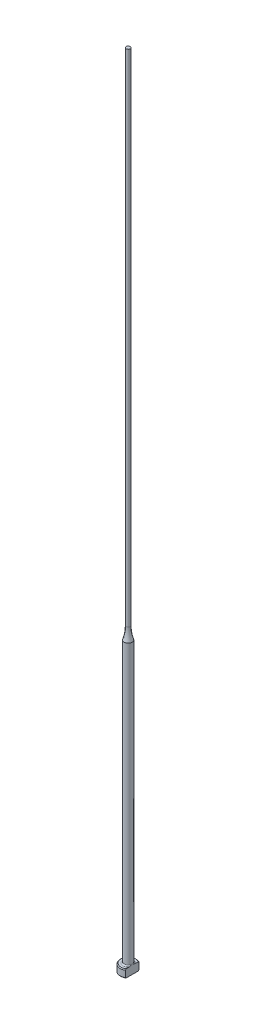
ISO-10303-21;
HEADER;
FILE_DESCRIPTION(('STEP AP214'),'2;1');
FILE_NAME('part.step','',(''),(''),'','','');
FILE_SCHEMA(('AUTOMOTIVE_DESIGN { 1 0 10303 214 1 1 1 1 }'));
ENDSEC;
DATA;
#1=APPLICATION_CONTEXT('core data for automotive mechanical design processes');
#2=APPLICATION_PROTOCOL_DEFINITION('international standard','automotive_design',2000,#1);
#3=PRODUCT_CONTEXT('',#1,'mechanical');
#4=PRODUCT('Part','Part','',(#3));
#5=PRODUCT_RELATED_PRODUCT_CATEGORY('part','',(#4));
#6=PRODUCT_DEFINITION_FORMATION('','',#4);
#7=PRODUCT_DEFINITION_CONTEXT('part definition',#1,'design');
#8=PRODUCT_DEFINITION('design','',#6,#7);
#9=PRODUCT_DEFINITION_SHAPE('','',#8);
#10=(LENGTH_UNIT() NAMED_UNIT(*) SI_UNIT(.MILLI.,.METRE.));
#11=(NAMED_UNIT(*) PLANE_ANGLE_UNIT() SI_UNIT($,.RADIAN.));
#12=(NAMED_UNIT(*) SI_UNIT($,.STERADIAN.) SOLID_ANGLE_UNIT());
#13=UNCERTAINTY_MEASURE_WITH_UNIT(LENGTH_MEASURE(1.E-05),#10,'distance_accuracy_value','');
#14=(GEOMETRIC_REPRESENTATION_CONTEXT(3) GLOBAL_UNCERTAINTY_ASSIGNED_CONTEXT((#13)) GLOBAL_UNIT_ASSIGNED_CONTEXT((#10,
#11,#12)) REPRESENTATION_CONTEXT('',''));
#15=CARTESIAN_POINT('',(0.,0.,0.));
#16=DIRECTION('',(0.,0.,1.));
#17=DIRECTION('',(1.,0.,0.));
#18=AXIS2_PLACEMENT_3D('',#15,#16,#17);
#19=CARTESIAN_POINT('',(-1.99999999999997,2.,0.));
#20=DIRECTION('',(0.,1.,0.));
#21=DIRECTION('',(0.,0.,1.));
#22=AXIS2_PLACEMENT_3D('',#19,#20,#21);
#23=PLANE('',#22);
#24=CARTESIAN_POINT('',(0.,2.,0.));
#25=DIRECTION('',(0.,1.,0.));
#26=DIRECTION('',(0.,0.,1.));
#27=AXIS2_PLACEMENT_3D('',#24,#25,#26);
#28=CIRCLE('',#27,1.8);
#29=CARTESIAN_POINT('',(0.999999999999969,2.,-1.4966629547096));
#30=VERTEX_POINT('',#29);
#31=CARTESIAN_POINT('',(0.999999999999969,2.,1.4966629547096));
#32=VERTEX_POINT('',#31);
#33=EDGE_CURVE('E187',#30,#32,#28,.T.);
#34=ORIENTED_EDGE('',*,*,#33,.T.);
#35=DIRECTION('',(0.,0.,-1.));
#36=VECTOR('',#35,1.);
#37=CARTESIAN_POINT('',(0.999999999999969,2.,0.));
#38=LINE('',#37,#36);
#39=CARTESIAN_POINT('',(0.999999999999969,2.00000000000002,0.830662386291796));
#40=VERTEX_POINT('',#39);
#41=EDGE_CURVE('E57',#32,#40,#38,.T.);
#42=ORIENTED_EDGE('',*,*,#41,.T.);
#43=CARTESIAN_POINT('',(0.,2.,0.));
#44=DIRECTION('',(0.,1.,0.));
#45=DIRECTION('',(0.,0.,1.));
#46=AXIS2_PLACEMENT_3D('',#43,#44,#45);
#47=CIRCLE('',#46,1.29999999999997);
#48=CARTESIAN_POINT('',(0.999999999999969,2.00000000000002,-0.830662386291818));
#49=VERTEX_POINT('',#48);
#50=EDGE_CURVE('E108',#40,#49,#47,.F.);
#51=ORIENTED_EDGE('',*,*,#50,.T.);
#52=EDGE_CURVE('E137',#49,#30,#38,.T.);
#53=ORIENTED_EDGE('',*,*,#52,.T.);
#54=EDGE_LOOP('',(#34,#42,#51,#53));
#55=FACE_BOUND('',#54,.T.);
#56=ADVANCED_FACE('F32',(#55),#23,.T.);
#57=CARTESIAN_POINT('',(0.,259.958771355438,0.));
#58=DIRECTION('',(0.,1.,0.));
#59=DIRECTION('',(0.,0.,1.));
#60=AXIS2_PLACEMENT_3D('',#57,#58,#59);
#61=CYLINDRICAL_SURFACE('',#60,1.99999999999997);
#62=CARTESIAN_POINT('',(0.,1.80000000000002,0.));
#63=DIRECTION('',(0.,1.,0.));
#64=DIRECTION('',(0.,0.,1.));
#65=AXIS2_PLACEMENT_3D('',#62,#63,#64);
#66=CIRCLE('',#65,1.99999999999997);
#67=CARTESIAN_POINT('',(0.999999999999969,1.80000000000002,1.73205080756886));
#68=VERTEX_POINT('',#67);
#69=CARTESIAN_POINT('',(0.999999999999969,1.80000000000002,-1.73205080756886));
#70=VERTEX_POINT('',#69);
#71=EDGE_CURVE('E105',#68,#70,#66,.F.);
#72=ORIENTED_EDGE('',*,*,#71,.T.);
#73=DIRECTION('',(0.,-1.,0.));
#74=VECTOR('',#73,1.);
#75=CARTESIAN_POINT('',(0.999999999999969,200.,-1.73205080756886));
#76=LINE('',#75,#74);
#77=CARTESIAN_POINT('',(0.999999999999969,0.199999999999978,-1.73205080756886));
#78=VERTEX_POINT('',#77);
#79=EDGE_CURVE('E193',#70,#78,#76,.T.);
#80=ORIENTED_EDGE('',*,*,#79,.T.);
#81=CARTESIAN_POINT('',(0.,0.199999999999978,0.));
#82=DIRECTION('',(0.,-1.,0.));
#83=DIRECTION('',(0.,0.,-1.));
#84=AXIS2_PLACEMENT_3D('',#81,#82,#83);
#85=CIRCLE('',#84,1.99999999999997);
#86=CARTESIAN_POINT('',(0.999999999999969,0.199999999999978,1.73205080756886));
#87=VERTEX_POINT('',#86);
#88=EDGE_CURVE('E100',#78,#87,#85,.F.);
#89=ORIENTED_EDGE('',*,*,#88,.T.);
#90=DIRECTION('',(0.,-1.,0.));
#91=VECTOR('',#90,1.);
#92=CARTESIAN_POINT('',(0.999999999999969,200.,1.73205080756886));
#93=LINE('',#92,#91);
#94=EDGE_CURVE('E93',#68,#87,#93,.T.);
#95=ORIENTED_EDGE('',*,*,#94,.F.);
#96=EDGE_LOOP('',(#72,#80,#89,#95));
#97=FACE_BOUND('',#96,.T.);
#98=ADVANCED_FACE('F158',(#97),#61,.T.);
#99=CARTESIAN_POINT('',(0.,0.,0.));
#100=DIRECTION('',(0.,-1.,0.));
#101=DIRECTION('',(0.,0.,-1.));
#102=AXIS2_PLACEMENT_3D('',#99,#100,#101);
#103=PLANE('',#102);
#104=CARTESIAN_POINT('',(0.,0.,0.));
#105=DIRECTION('',(0.,-1.,0.));
#106=DIRECTION('',(0.,0.,-1.));
#107=AXIS2_PLACEMENT_3D('',#104,#105,#106);
#108=CIRCLE('',#107,1.8);
#109=CARTESIAN_POINT('',(0.999999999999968,0.,1.49666295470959));
#110=VERTEX_POINT('',#109);
#111=CARTESIAN_POINT('',(0.999999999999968,0.,-1.49666295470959));
#112=VERTEX_POINT('',#111);
#113=EDGE_CURVE('E98',#110,#112,#108,.T.);
#114=ORIENTED_EDGE('',*,*,#113,.T.);
#115=DIRECTION('',(0.,0.,1.));
#116=VECTOR('',#115,1.);
#117=CARTESIAN_POINT('',(0.999999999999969,0.,-1.73205080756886));
#118=LINE('',#117,#116);
#119=EDGE_CURVE('E83',#112,#110,#118,.T.);
#120=ORIENTED_EDGE('',*,*,#119,.T.);
#121=EDGE_LOOP('',(#114,#120));
#122=FACE_BOUND('',#121,.T.);
#123=ADVANCED_FACE('F103',(#122),#103,.T.);
#124=CARTESIAN_POINT('',(0.,2.,0.));
#125=DIRECTION('',(0.,-1.,0.));
#126=DIRECTION('',(0.,0.,-1.));
#127=AXIS2_PLACEMENT_3D('',#124,#125,#126);
#128=CONICAL_SURFACE('',#127,1.8,0.785398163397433);
#129=ORIENTED_EDGE('',*,*,#71,.F.);
#130=CARTESIAN_POINT('',(0.999999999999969,-0.143084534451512,3.81417299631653));
#131=CARTESIAN_POINT('',(0.999999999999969,-0.0593997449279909,3.72765647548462));
#132=CARTESIAN_POINT('',(0.999999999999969,0.0241940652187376,3.64105173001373));
#133=CARTESIAN_POINT('',(0.999999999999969,0.191148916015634,3.46761616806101));
#134=CARTESIAN_POINT('',(0.999999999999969,0.274509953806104,3.38078534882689));
#135=CARTESIAN_POINT('',(0.999999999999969,0.524249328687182,3.11979400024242));
#136=CARTESIAN_POINT('',(0.999999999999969,0.690198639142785,2.94522254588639));
#137=CARTESIAN_POINT('',(0.999999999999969,1.016975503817,2.59782670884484));
#138=CARTESIAN_POINT('',(0.999999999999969,1.17783928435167,2.42503661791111));
#139=CARTESIAN_POINT('',(0.999999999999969,1.41669118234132,2.16364984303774));
#140=CARTESIAN_POINT('',(0.999999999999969,1.49589273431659,2.07616357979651));
#141=CARTESIAN_POINT('',(0.999999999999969,1.65313803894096,1.90015721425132));
#142=CARTESIAN_POINT('',(0.999999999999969,1.73118183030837,1.81163714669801));
#143=CARTESIAN_POINT('',(0.999999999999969,1.85567318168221,1.66767927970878));
#144=CARTESIAN_POINT('',(0.999999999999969,1.90265415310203,1.61270332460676));
#145=CARTESIAN_POINT('',(0.999999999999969,1.99577882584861,1.50203557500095));
#146=CARTESIAN_POINT('',(0.999999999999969,2.04192244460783,1.44634371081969));
#147=CARTESIAN_POINT('',(0.999999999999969,2.1335659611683,1.3334548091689));
#148=CARTESIAN_POINT('',(0.999999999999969,2.17905399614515,1.2762481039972));
#149=CARTESIAN_POINT('',(0.999999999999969,2.26844283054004,1.16060976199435));
#150=CARTESIAN_POINT('',(0.999999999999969,2.31234379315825,1.10217825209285));
#151=CARTESIAN_POINT('',(0.999999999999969,2.39853453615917,0.982773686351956));
#152=CARTESIAN_POINT('',(0.999999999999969,2.44078986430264,0.921775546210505));
#153=CARTESIAN_POINT('',(0.999999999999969,2.52187810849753,0.797387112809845));
#154=CARTESIAN_POINT('',(0.999999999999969,2.56070631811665,0.733993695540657));
#155=CARTESIAN_POINT('',(0.999999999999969,2.63248592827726,0.604932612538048));
#156=CARTESIAN_POINT('',(0.999999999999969,2.66550424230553,0.539302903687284));
#157=CARTESIAN_POINT('',(0.999999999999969,2.72301550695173,0.404437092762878));
#158=CARTESIAN_POINT('',(0.999999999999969,2.74753707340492,0.33521401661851));
#159=CARTESIAN_POINT('',(0.999999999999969,2.77407110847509,0.231400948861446));
#160=CARTESIAN_POINT('',(0.999999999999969,2.7811074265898,0.198093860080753));
#161=CARTESIAN_POINT('',(0.999999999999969,2.79200506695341,0.130954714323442));
#162=CARTESIAN_POINT('',(0.999999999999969,2.79586666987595,0.0971227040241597));
#163=CARTESIAN_POINT('',(0.999999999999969,2.8001390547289,0.0293410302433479));
#164=CARTESIAN_POINT('',(0.999999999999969,2.80056046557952,-0.00460794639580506));
#165=CARTESIAN_POINT('',(0.999999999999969,2.79795882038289,-0.0723663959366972));
#166=CARTESIAN_POINT('',(0.999999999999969,2.79493547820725,-0.106175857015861));
#167=CARTESIAN_POINT('',(0.999999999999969,2.78105481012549,-0.206326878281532));
#168=CARTESIAN_POINT('',(0.999999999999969,2.7654214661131,-0.272037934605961));
#169=CARTESIAN_POINT('',(0.999999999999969,2.73477554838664,-0.368312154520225));
#170=CARTESIAN_POINT('',(0.999999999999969,2.72331063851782,-0.40012349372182));
#171=CARTESIAN_POINT('',(0.999999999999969,2.69840546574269,-0.462964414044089));
#172=CARTESIAN_POINT('',(0.999999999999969,2.68496560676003,-0.493994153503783));
#173=CARTESIAN_POINT('',(0.999999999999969,2.64209309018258,-0.586298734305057));
#174=CARTESIAN_POINT('',(0.999999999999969,2.61022871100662,-0.64643570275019));
#175=CARTESIAN_POINT('',(0.999999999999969,2.54228534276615,-0.764304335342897));
#176=CARTESIAN_POINT('',(0.999999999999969,2.50620119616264,-0.822032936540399));
#177=CARTESIAN_POINT('',(0.999999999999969,2.43107084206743,-0.935840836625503));
#178=CARTESIAN_POINT('',(0.999999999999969,2.39201347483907,-0.991912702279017));
#179=CARTESIAN_POINT('',(0.999999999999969,2.31195870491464,-1.10259849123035));
#180=CARTESIAN_POINT('',(0.999999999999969,2.27096226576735,-1.15721311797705));
#181=CARTESIAN_POINT('',(0.999999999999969,2.18701695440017,-1.26606869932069));
#182=CARTESIAN_POINT('',(0.999999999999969,2.14404946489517,-1.32029522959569));
#183=CARTESIAN_POINT('',(0.999999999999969,2.05705050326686,-1.4278898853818));
#184=CARTESIAN_POINT('',(0.999999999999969,2.01301896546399,-1.48125795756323));
#185=CARTESIAN_POINT('',(0.999999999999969,1.87995068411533,-1.64010952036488));
#186=CARTESIAN_POINT('',(0.999999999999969,1.78973357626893,-1.74460261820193));
#187=CARTESIAN_POINT('',(0.999999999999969,1.62290341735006,-1.93426834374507));
#188=CARTESIAN_POINT('',(0.999999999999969,1.54658658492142,-2.01970404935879));
#189=CARTESIAN_POINT('',(0.999999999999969,1.39301250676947,-2.18973019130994));
#190=CARTESIAN_POINT('',(0.999999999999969,1.31575523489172,-2.27432060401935));
#191=CARTESIAN_POINT('',(0.999999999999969,1.08283440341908,-2.52732479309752));
#192=CARTESIAN_POINT('',(0.999999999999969,0.926165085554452,-2.69481086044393));
#193=CARTESIAN_POINT('',(0.999999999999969,0.617772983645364,-3.02147252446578));
#194=CARTESIAN_POINT('',(0.999999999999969,0.466111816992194,-3.18070657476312));
#195=CARTESIAN_POINT('',(0.999999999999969,0.238015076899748,-3.41880818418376));
#196=CARTESIAN_POINT('',(0.999999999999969,0.161924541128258,-3.49800657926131));
#197=CARTESIAN_POINT('',(0.999999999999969,0.009553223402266,-3.65621892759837));
#198=CARTESIAN_POINT('',(0.999999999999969,-0.0667275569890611,-3.73523288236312));
#199=CARTESIAN_POINT('',(0.999999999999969,-0.143084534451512,-3.81417299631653));
#200=B_SPLINE_CURVE_WITH_KNOTS('',3,(#130,#131,#132,#133,#134,#135,#136,#137,#138,#139,#140,
#141,#142,#143,#144,#145,#146,#147,#148,#149,#150,#151,#152,#153,#154,#155,#156,#157,#158,#159,
#160,#161,#162,#163,#164,#165,#166,#167,#168,#169,#170,#171,#172,#173,#174,#175,#176,#177,#178,
#179,#180,#181,#182,#183,#184,#185,#186,#187,#188,#189,#190,#191,#192,#193,#194,#195,#196,#197,
#198,#199),.UNSPECIFIED.,.F.,.F.,(4,2,2,2,2,2,2,2,2,2,2,2,2,2,2,2,2,2,2,2,2,2,2,2,2,2,2,2,2,2,2,
2,2,2,4),(0.,0.36110162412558,0.722207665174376,1.44478731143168,2.15299784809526,
2.5070263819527,2.8610430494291,3.07798416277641,3.29494655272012,3.51418925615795,
3.73340935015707,3.95594813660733,4.17878792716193,4.39886399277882,4.61819150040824,
4.72018864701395,4.82217677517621,4.92384967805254,5.02553102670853,5.22698459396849,
5.32838854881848,5.42977179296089,5.63365200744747,5.83778406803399,6.04272417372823,
6.24756349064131,6.45510395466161,6.66265726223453,7.07676259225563,7.42043039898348,
7.7641077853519,8.45210822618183,9.1118082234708,9.44129145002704,9.77077197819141),.UNSPECIFIED.);
#201=EDGE_CURVE('E136',#68,#32,#200,.T.);
#202=ORIENTED_EDGE('',*,*,#201,.T.);
#203=ORIENTED_EDGE('',*,*,#33,.F.);
#204=EDGE_CURVE('E128',#30,#70,#200,.T.);
#205=ORIENTED_EDGE('',*,*,#204,.T.);
#206=EDGE_LOOP('',(#129,#202,#203,#205));
#207=FACE_BOUND('',#206,.T.);
#208=ADVANCED_FACE('F144',(#207),#128,.T.);
#209=CARTESIAN_POINT('',(0.,0.199999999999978,0.));
#210=DIRECTION('',(0.,1.,0.));
#211=DIRECTION('',(0.,0.,1.));
#212=AXIS2_PLACEMENT_3D('',#209,#210,#211);
#213=CONICAL_SURFACE('',#212,1.99999999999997,0.785398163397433);
#214=ORIENTED_EDGE('',*,*,#88,.F.);
#215=CARTESIAN_POINT('',(0.999999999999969,2.14308453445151,-3.81417299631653));
#216=CARTESIAN_POINT('',(0.999999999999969,2.05939974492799,-3.72765647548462));
#217=CARTESIAN_POINT('',(0.999999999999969,1.97580593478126,-3.64105173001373));
#218=CARTESIAN_POINT('',(0.999999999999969,1.80885108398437,-3.46761616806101));
#219=CARTESIAN_POINT('',(0.999999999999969,1.7254900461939,-3.38078534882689));
#220=CARTESIAN_POINT('',(0.999999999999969,1.47575067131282,-3.11979400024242));
#221=CARTESIAN_POINT('',(0.999999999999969,1.30980136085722,-2.94522254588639));
#222=CARTESIAN_POINT('',(0.999999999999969,0.983024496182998,-2.59782670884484));
#223=CARTESIAN_POINT('',(0.999999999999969,0.822160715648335,-2.42503661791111));
#224=CARTESIAN_POINT('',(0.999999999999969,0.583308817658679,-2.16364984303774));
#225=CARTESIAN_POINT('',(0.999999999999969,0.504107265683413,-2.07616357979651));
#226=CARTESIAN_POINT('',(0.999999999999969,0.346861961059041,-1.90015721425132));
#227=CARTESIAN_POINT('',(0.999999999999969,0.268818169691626,-1.81163714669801));
#228=CARTESIAN_POINT('',(0.999999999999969,0.144326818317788,-1.66767927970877));
#229=CARTESIAN_POINT('',(0.999999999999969,0.0973458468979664,-1.61270332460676));
#230=CARTESIAN_POINT('',(0.999999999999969,0.00422117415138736,-1.50203557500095));
#231=CARTESIAN_POINT('',(0.999999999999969,-0.0419224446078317,-1.44634371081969));
#232=CARTESIAN_POINT('',(0.999999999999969,-0.133565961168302,-1.3334548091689));
#233=CARTESIAN_POINT('',(0.999999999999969,-0.179053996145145,-1.2762481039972));
#234=CARTESIAN_POINT('',(0.999999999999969,-0.268442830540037,-1.16060976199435));
#235=CARTESIAN_POINT('',(0.999999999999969,-0.31234379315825,-1.10217825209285));
#236=CARTESIAN_POINT('',(0.999999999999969,-0.398534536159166,-0.982773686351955));
#237=CARTESIAN_POINT('',(0.999999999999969,-0.440789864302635,-0.921775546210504));
#238=CARTESIAN_POINT('',(0.999999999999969,-0.521878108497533,-0.797387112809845));
#239=CARTESIAN_POINT('',(0.999999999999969,-0.560706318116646,-0.733993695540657));
#240=CARTESIAN_POINT('',(0.999999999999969,-0.632485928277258,-0.604932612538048));
#241=CARTESIAN_POINT('',(0.999999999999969,-0.665504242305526,-0.539302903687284));
#242=CARTESIAN_POINT('',(0.999999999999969,-0.723015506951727,-0.404437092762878));
#243=CARTESIAN_POINT('',(0.999999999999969,-0.747537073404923,-0.33521401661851));
#244=CARTESIAN_POINT('',(0.999999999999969,-0.774071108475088,-0.231400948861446));
#245=CARTESIAN_POINT('',(0.999999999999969,-0.781107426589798,-0.198093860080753));
#246=CARTESIAN_POINT('',(0.999999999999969,-0.792005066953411,-0.130954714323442));
#247=CARTESIAN_POINT('',(0.999999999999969,-0.795866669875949,-0.0971227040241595));
#248=CARTESIAN_POINT('',(0.999999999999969,-0.800139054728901,-0.0293410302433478));
#249=CARTESIAN_POINT('',(0.999999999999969,-0.80056046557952,0.00460794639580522));
#250=CARTESIAN_POINT('',(0.999999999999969,-0.797958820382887,0.0723663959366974));
#251=CARTESIAN_POINT('',(0.999999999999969,-0.794935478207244,0.106175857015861));
#252=CARTESIAN_POINT('',(0.999999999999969,-0.78105481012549,0.206326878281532));
#253=CARTESIAN_POINT('',(0.999999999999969,-0.765421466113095,0.272037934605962));
#254=CARTESIAN_POINT('',(0.999999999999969,-0.734775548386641,0.368312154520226));
#255=CARTESIAN_POINT('',(0.999999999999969,-0.723310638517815,0.40012349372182));
#256=CARTESIAN_POINT('',(0.999999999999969,-0.698405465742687,0.46296441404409));
#257=CARTESIAN_POINT('',(0.999999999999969,-0.684965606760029,0.493994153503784));
#258=CARTESIAN_POINT('',(0.999999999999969,-0.642093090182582,0.586298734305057));
#259=CARTESIAN_POINT('',(0.999999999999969,-0.610228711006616,0.64643570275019));
#260=CARTESIAN_POINT('',(0.999999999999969,-0.542285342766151,0.764304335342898));
#261=CARTESIAN_POINT('',(0.999999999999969,-0.506201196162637,0.822032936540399));
#262=CARTESIAN_POINT('',(0.999999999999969,-0.431070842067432,0.935840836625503));
#263=CARTESIAN_POINT('',(0.999999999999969,-0.392013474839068,0.991912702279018));
#264=CARTESIAN_POINT('',(0.999999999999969,-0.311958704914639,1.10259849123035));
#265=CARTESIAN_POINT('',(0.999999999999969,-0.27096226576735,1.15721311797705));
#266=CARTESIAN_POINT('',(0.999999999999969,-0.187016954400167,1.26606869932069));
#267=CARTESIAN_POINT('',(0.999999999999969,-0.144049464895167,1.32029522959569));
#268=CARTESIAN_POINT('',(0.999999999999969,-0.0570505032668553,1.4278898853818));
#269=CARTESIAN_POINT('',(0.999999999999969,-0.0130189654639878,1.48125795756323));
#270=CARTESIAN_POINT('',(0.999999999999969,0.120049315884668,1.64010952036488));
#271=CARTESIAN_POINT('',(0.999999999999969,0.210266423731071,1.74460261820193));
#272=CARTESIAN_POINT('',(0.999999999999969,0.377096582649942,1.93426834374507));
#273=CARTESIAN_POINT('',(0.999999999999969,0.453413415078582,2.01970404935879));
#274=CARTESIAN_POINT('',(0.999999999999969,0.606987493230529,2.18973019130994));
#275=CARTESIAN_POINT('',(0.999999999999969,0.684244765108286,2.27432060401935));
#276=CARTESIAN_POINT('',(0.999999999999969,0.917165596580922,2.52732479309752));
#277=CARTESIAN_POINT('',(0.999999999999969,1.07383491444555,2.69481086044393));
#278=CARTESIAN_POINT('',(0.999999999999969,1.38222701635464,3.02147252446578));
#279=CARTESIAN_POINT('',(0.999999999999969,1.53388818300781,3.18070657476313));
#280=CARTESIAN_POINT('',(0.999999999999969,1.76198492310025,3.41880818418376));
#281=CARTESIAN_POINT('',(0.999999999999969,1.83807545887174,3.49800657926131));
#282=CARTESIAN_POINT('',(0.999999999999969,1.99044677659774,3.65621892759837));
#283=CARTESIAN_POINT('',(0.999999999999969,2.06672755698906,3.73523288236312));
#284=CARTESIAN_POINT('',(0.999999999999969,2.14308453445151,3.81417299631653));
#285=B_SPLINE_CURVE_WITH_KNOTS('',3,(#215,#216,#217,#218,#219,#220,#221,#222,#223,#224,#225,
#226,#227,#228,#229,#230,#231,#232,#233,#234,#235,#236,#237,#238,#239,#240,#241,#242,#243,#244,
#245,#246,#247,#248,#249,#250,#251,#252,#253,#254,#255,#256,#257,#258,#259,#260,#261,#262,#263,
#264,#265,#266,#267,#268,#269,#270,#271,#272,#273,#274,#275,#276,#277,#278,#279,#280,#281,#282,
#283,#284),.UNSPECIFIED.,.F.,.F.,(4,2,2,2,2,2,2,2,2,2,2,2,2,2,2,2,2,2,2,2,2,2,2,2,2,2,2,2,2,2,2,
2,2,2,4),(0.,0.36110162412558,0.722207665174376,1.44478731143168,2.15299784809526,
2.5070263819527,2.8610430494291,3.07798416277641,3.29494655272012,3.51418925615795,
3.73340935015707,3.95594813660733,4.17878792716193,4.39886399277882,4.61819150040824,
4.72018864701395,4.82217677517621,4.92384967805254,5.02553102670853,5.22698459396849,
5.32838854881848,5.42977179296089,5.63365200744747,5.83778406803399,6.04272417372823,
6.24756349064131,6.45510395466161,6.66265726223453,7.07676259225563,7.42043039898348,
7.7641077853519,8.45210822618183,9.1118082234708,9.44129145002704,9.77077197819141),.UNSPECIFIED.);
#286=EDGE_CURVE('E86',#78,#112,#285,.T.);
#287=ORIENTED_EDGE('',*,*,#286,.T.);
#288=ORIENTED_EDGE('',*,*,#113,.F.);
#289=EDGE_CURVE('E89',#110,#87,#285,.T.);
#290=ORIENTED_EDGE('',*,*,#289,.T.);
#291=EDGE_LOOP('',(#214,#287,#288,#290));
#292=FACE_BOUND('',#291,.T.);
#293=ADVANCED_FACE('F97',(#292),#213,.T.);
#294=CARTESIAN_POINT('',(0.,2.30000000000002,0.));
#295=DIRECTION('',(0.,1.,0.));
#296=DIRECTION('',(0.,0.,1.));
#297=AXIS2_PLACEMENT_3D('',#294,#295,#296);
#298=TOROIDAL_SURFACE('',#297,1.29999999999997,0.3);
#299=CARTESIAN_POINT('',(0.999999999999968,2.30000000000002,0.));
#300=CARTESIAN_POINT('',(0.999999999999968,2.30000064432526,8.65739792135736E-12));
#301=CARTESIAN_POINT('',(0.999999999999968,2.30000128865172,-9.05742230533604E-08));
#302=CARTESIAN_POINT('',(0.999999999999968,2.30000254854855,-3.98319619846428E-07));
#303=CARTESIAN_POINT('',(0.999999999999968,2.30000316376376,-6.16748312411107E-07));
#304=CARTESIAN_POINT('',(0.999999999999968,2.30000438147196,-1.15047367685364E-06));
#305=CARTESIAN_POINT('',(0.999999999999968,2.30000498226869,-1.46954564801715E-06));
#306=CARTESIAN_POINT('',(0.999999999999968,2.30000613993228,-2.17388585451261E-06));
#307=CARTESIAN_POINT('',(0.999999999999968,2.30000669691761,-2.55896592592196E-06));
#308=CARTESIAN_POINT('',(0.999999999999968,2.30000847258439,-3.89137454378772E-06));
#309=CARTESIAN_POINT('',(0.999999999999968,2.30000962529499,-4.92725692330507E-06));
#310=CARTESIAN_POINT('',(0.999999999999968,2.30001175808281,-7.12255375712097E-06));
#311=CARTESIAN_POINT('',(0.999999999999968,2.30001274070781,-8.27963245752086E-06));
#312=CARTESIAN_POINT('',(0.999999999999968,2.30001619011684,-1.25710395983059E-05));
#313=CARTESIAN_POINT('',(0.999999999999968,2.30001847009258,-1.58589994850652E-05));
#314=CARTESIAN_POINT('',(0.999999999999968,2.30002241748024,-2.25210462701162E-05));
#315=CARTESIAN_POINT('',(0.999999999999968,2.30002411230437,-2.58796667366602E-05));
#316=CARTESIAN_POINT('',(0.999999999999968,2.30003085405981,-3.9494195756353E-05));
#317=CARTESIAN_POINT('',(0.999999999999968,2.30003568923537,-4.98493079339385E-05));
#318=CARTESIAN_POINT('',(0.999999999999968,2.30004388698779,-6.96407730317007E-05));
#319=CARTESIAN_POINT('',(0.999999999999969,2.30004735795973,-7.90309862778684E-05));
#320=CARTESIAN_POINT('',(0.999999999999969,2.30007348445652,-0.00014405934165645));
#321=CARTESIAN_POINT('',(0.999999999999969,2.30010510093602,-0.000195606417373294));
#322=CARTESIAN_POINT('',(0.999999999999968,2.30022061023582,-0.000391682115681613));
#323=CARTESIAN_POINT('',(0.999999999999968,2.30029784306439,-0.000539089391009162));
#324=CARTESIAN_POINT('',(0.999999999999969,2.30059433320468,-0.00109591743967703));
#325=CARTESIAN_POINT('',(0.999999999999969,2.30082052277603,-0.00150237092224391));
#326=CARTESIAN_POINT('',(0.999999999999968,2.30171558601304,-0.00311941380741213));
#327=CARTESIAN_POINT('',(0.999999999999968,2.30237677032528,-0.00433326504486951));
#328=CARTESIAN_POINT('',(0.999999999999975,2.31602135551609,-0.0293725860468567));
#329=CARTESIAN_POINT('',(0.99999999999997,2.32909104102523,-0.0531623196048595));
#330=CARTESIAN_POINT('',(0.999999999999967,2.35458080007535,-0.100088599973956));
#331=CARTESIAN_POINT('',(0.999999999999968,2.36700820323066,-0.123221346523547));
#332=CARTESIAN_POINT('',(0.999999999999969,2.39281545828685,-0.172044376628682));
#333=CARTESIAN_POINT('',(0.999999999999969,2.40616161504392,-0.197752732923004));
#334=CARTESIAN_POINT('',(0.999999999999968,2.43235418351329,-0.249714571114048));
#335=CARTESIAN_POINT('',(0.999999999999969,2.44519503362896,-0.275970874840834));
#336=CARTESIAN_POINT('',(0.999999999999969,2.46718175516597,-0.322864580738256));
#337=CARTESIAN_POINT('',(0.999999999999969,2.47650292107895,-0.34341923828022));
#338=CARTESIAN_POINT('',(0.999999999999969,2.49448113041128,-0.384761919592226));
#339=CARTESIAN_POINT('',(0.999999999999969,2.50313958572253,-0.405549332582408));
#340=CARTESIAN_POINT('',(0.999999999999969,2.52764343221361,-0.467585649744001));
#341=CARTESIAN_POINT('',(0.999999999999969,2.54239224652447,-0.509286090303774));
#342=CARTESIAN_POINT('',(0.999999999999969,2.56458900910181,-0.58349816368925));
#343=CARTESIAN_POINT('',(0.999999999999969,2.57294045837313,-0.61573699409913));
#344=CARTESIAN_POINT('',(0.999999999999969,2.58691787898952,-0.682155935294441));
#345=CARTESIAN_POINT('',(0.999999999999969,2.5924232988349,-0.716362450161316));
#346=CARTESIAN_POINT('',(0.999999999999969,2.59932200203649,-0.784996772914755));
#347=CARTESIAN_POINT('',(0.999999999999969,2.60074119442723,-0.819421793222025));
#348=CARTESIAN_POINT('',(0.999999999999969,2.59853032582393,-0.88779225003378));
#349=CARTESIAN_POINT('',(0.999999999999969,2.59495737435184,-0.921738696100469));
#350=CARTESIAN_POINT('',(0.999999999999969,2.58381038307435,-0.977927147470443));
#351=CARTESIAN_POINT('',(0.999999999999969,2.57785171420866,-1.00048693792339));
#352=CARTESIAN_POINT('',(0.999999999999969,2.56267132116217,-1.0445512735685));
#353=CARTESIAN_POINT('',(0.999999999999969,2.55344592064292,-1.06605459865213));
#354=CARTESIAN_POINT('',(0.999999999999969,2.53348156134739,-1.10327564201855));
#355=CARTESIAN_POINT('',(0.999999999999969,2.52335553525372,-1.11931996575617));
#356=CARTESIAN_POINT('',(0.999999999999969,2.50063930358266,-1.1495565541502));
#357=CARTESIAN_POINT('',(0.999999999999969,2.48805327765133,-1.16375189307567));
#358=CARTESIAN_POINT('',(0.999999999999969,2.46313284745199,-1.18709127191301));
#359=CARTESIAN_POINT('',(0.999999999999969,2.45121755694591,-1.19668155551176));
#360=CARTESIAN_POINT('',(0.999999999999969,2.4259612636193,-1.21377371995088));
#361=CARTESIAN_POINT('',(0.999999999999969,2.41262072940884,-1.2212762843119));
#362=CARTESIAN_POINT('',(0.999999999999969,2.38471163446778,-1.23381879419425));
#363=CARTESIAN_POINT('',(0.999999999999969,2.37013565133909,-1.23884240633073));
#364=CARTESIAN_POINT('',(0.999999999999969,2.34029120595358,-1.2460136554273));
#365=CARTESIAN_POINT('',(0.999999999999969,2.32502317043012,-1.24816304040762));
#366=CARTESIAN_POINT('',(0.999999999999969,2.29609418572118,-1.24936303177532));
#367=CARTESIAN_POINT('',(0.999999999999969,2.28244572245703,-1.24873511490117));
#368=CARTESIAN_POINT('',(0.999999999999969,2.25546467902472,-1.24513625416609));
#369=CARTESIAN_POINT('',(0.999999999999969,2.2421320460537,-1.24216570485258));
#370=CARTESIAN_POINT('',(0.999999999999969,2.21644742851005,-1.23414136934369));
#371=CARTESIAN_POINT('',(0.999999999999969,2.20408009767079,-1.22913614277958));
#372=CARTESIAN_POINT('',(0.999999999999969,2.18026539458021,-1.2172891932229));
#373=CARTESIAN_POINT('',(0.999999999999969,2.16881815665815,-1.21044720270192));
#374=CARTESIAN_POINT('',(0.999999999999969,2.14602713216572,-1.19450929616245));
#375=CARTESIAN_POINT('',(0.999999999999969,2.1347876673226,-1.18526487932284));
#376=CARTESIAN_POINT('',(0.999999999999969,2.11372805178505,-1.16528066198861));
#377=CARTESIAN_POINT('',(0.999999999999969,2.1039092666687,-1.15453944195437));
#378=CARTESIAN_POINT('',(0.999999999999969,2.08131380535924,-1.12639326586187));
#379=CARTESIAN_POINT('',(0.999999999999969,2.06941227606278,-1.10828305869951));
#380=CARTESIAN_POINT('',(0.999999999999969,2.04871157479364,-1.07041295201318));
#381=CARTESIAN_POINT('',(0.999999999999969,2.03991325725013,-1.05065259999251));
#382=CARTESIAN_POINT('',(0.999999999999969,2.02219264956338,-1.00203188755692));
#383=CARTESIAN_POINT('',(0.999999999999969,2.01461756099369,-0.97268259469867));
#384=CARTESIAN_POINT('',(0.999999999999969,2.00410660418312,-0.912914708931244));
#385=CARTESIAN_POINT('',(0.999999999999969,2.00122174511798,-0.882487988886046));
#386=CARTESIAN_POINT('',(0.999999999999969,1.99886242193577,-0.803189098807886));
#387=CARTESIAN_POINT('',(0.999999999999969,2.0024814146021,-0.754226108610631));
#388=CARTESIAN_POINT('',(0.999999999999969,2.01327071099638,-0.68272407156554));
#389=CARTESIAN_POINT('',(0.999999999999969,2.01762186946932,-0.659663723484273));
#390=CARTESIAN_POINT('',(0.999999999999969,2.02775671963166,-0.613959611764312));
#391=CARTESIAN_POINT('',(0.999999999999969,2.03353398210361,-0.591314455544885));
#392=CARTESIAN_POINT('',(0.999999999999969,2.05232003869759,-0.525222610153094));
#393=CARTESIAN_POINT('',(0.999999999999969,2.0670175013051,-0.482256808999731));
#394=CARTESIAN_POINT('',(0.999999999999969,2.09166172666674,-0.418361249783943));
#395=CARTESIAN_POINT('',(0.999999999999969,2.10040936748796,-0.396945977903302));
#396=CARTESIAN_POINT('',(0.999999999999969,2.11862724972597,-0.354367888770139));
#397=CARTESIAN_POINT('',(0.999999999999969,2.12809902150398,-0.333205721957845));
#398=CARTESIAN_POINT('',(0.999999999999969,2.1505479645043,-0.284809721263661));
#399=CARTESIAN_POINT('',(0.999999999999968,2.16372144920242,-0.257667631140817));
#400=CARTESIAN_POINT('',(0.999999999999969,2.19063957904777,-0.203972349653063));
#401=CARTESIAN_POINT('',(0.999999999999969,2.20437810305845,-0.177416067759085));
#402=CARTESIAN_POINT('',(0.999999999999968,2.23096755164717,-0.127000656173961));
#403=CARTESIAN_POINT('',(0.999999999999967,2.24378127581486,-0.103121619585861));
#404=CARTESIAN_POINT('',(0.99999999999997,2.2700750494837,-0.0546869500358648));
#405=CARTESIAN_POINT('',(0.999999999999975,2.28356304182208,-0.0301354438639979));
#406=CARTESIAN_POINT('',(0.999999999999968,2.29762327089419,-0.00433318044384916));
#407=CARTESIAN_POINT('',(0.999999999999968,2.29828450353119,-0.00311924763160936));
#408=CARTESIAN_POINT('',(0.999999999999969,2.29917957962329,-0.0015021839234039));
#409=CARTESIAN_POINT('',(0.999999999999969,2.29940573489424,-0.00109579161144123));
#410=CARTESIAN_POINT('',(0.999999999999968,2.29970218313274,-0.000539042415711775));
#411=CARTESIAN_POINT('',(0.999999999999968,2.29977940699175,-0.00039165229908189));
#412=CARTESIAN_POINT('',(0.999999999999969,2.299894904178,-0.000195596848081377));
#413=CARTESIAN_POINT('',(0.999999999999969,2.29992651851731,-0.000144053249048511));
#414=CARTESIAN_POINT('',(0.999999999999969,2.29995264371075,-7.90290824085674E-05));
#415=CARTESIAN_POINT('',(0.999999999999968,2.29995611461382,-6.96391975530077E-05));
#416=CARTESIAN_POINT('',(0.999999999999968,2.29996431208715,-4.98484228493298E-05));
#417=CARTESIAN_POINT('',(0.999999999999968,2.29996914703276,-3.94936645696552E-05));
#418=CARTESIAN_POINT('',(0.999999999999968,2.2999758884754,-2.58795342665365E-05));
#419=CARTESIAN_POINT('',(0.999999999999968,2.29997758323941,-2.25209724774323E-05));
#420=CARTESIAN_POINT('',(0.999999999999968,2.29998153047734,-1.58590310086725E-05));
#421=CARTESIAN_POINT('',(0.999999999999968,2.29998381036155,-1.25711163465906E-05));
#422=CARTESIAN_POINT('',(0.999999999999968,2.29998725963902,-8.2797491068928E-06));
#423=CARTESIAN_POINT('',(0.999999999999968,2.29998824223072,-7.12267538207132E-06));
#424=CARTESIAN_POINT('',(0.999999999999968,2.29999037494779,-4.92738159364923E-06));
#425=CARTESIAN_POINT('',(0.999999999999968,2.29999152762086,-3.89149712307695E-06));
#426=CARTESIAN_POINT('',(0.999999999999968,2.29999330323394,-2.55907740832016E-06));
#427=CARTESIAN_POINT('',(0.999999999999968,2.29999386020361,-2.17399249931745E-06));
#428=CARTESIAN_POINT('',(0.999999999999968,2.2999950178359,-1.46963989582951E-06));
#429=CARTESIAN_POINT('',(0.999999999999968,2.299995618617,-1.15056035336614E-06));
#430=CARTESIAN_POINT('',(0.999999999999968,2.29999683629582,-6.16816558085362E-07));
#431=CARTESIAN_POINT('',(0.999999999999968,2.29999745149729,-3.98377207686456E-07));
#432=CARTESIAN_POINT('',(0.999999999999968,2.29999871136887,-9.06063086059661E-08));
#433=CARTESIAN_POINT('',(0.999999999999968,2.29999935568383,-8.65727637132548E-12));
#434=CARTESIAN_POINT('',(0.999999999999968,2.30000000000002,0.));
#435=B_SPLINE_CURVE_WITH_KNOTS('',3,(#299,#300,#301,#302,#303,#304,#305,#306,#307,#308,#309,
#310,#311,#312,#313,#314,#315,#316,#317,#318,#319,#320,#321,#322,#323,#324,#325,#326,#327,#328,
#329,#330,#331,#332,#333,#334,#335,#336,#337,#338,#339,#340,#341,#342,#343,#344,#345,#346,#347,
#348,#349,#350,#351,#352,#353,#354,#355,#356,#357,#358,#359,#360,#361,#362,#363,#364,#365,#366,
#367,#368,#369,#370,#371,#372,#373,#374,#375,#376,#377,#378,#379,#380,#381,#382,#383,#384,#385,
#386,#387,#388,#389,#390,#391,#392,#393,#394,#395,#396,#397,#398,#399,#400,#401,#402,#403,#404,
#405,#406,#407,#408,#409,#410,#411,#412,#413,#414,#415,#416,#417,#418,#419,#420,#421,#422,#423,
#424,#425,#426,#427,#428,#429,#430,#431,#432,#433,#434),.UNSPECIFIED.,.T.,.F.,(4,2,2,2,2,2,2,2,
2,2,2,2,2,2,2,2,2,2,2,2,2,2,2,2,2,2,2,2,2,2,2,2,2,2,2,2,2,2,2,2,2,2,2,2,2,2,2,2,2,2,2,2,2,2,2,2,
2,2,2,2,2,2,2,2,2,2,2,4),(0.,1.93088000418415E-06,3.88121487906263E-06,5.91576028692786E-06,
7.94459960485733E-06,1.25713540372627E-05,1.71213139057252E-05,2.90751202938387E-05,
4.03508177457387E-05,7.46190414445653E-05,0.000104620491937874,0.000284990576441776,
0.000785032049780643,0.00217951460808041,0.00632720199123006,0.0877445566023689,
0.166524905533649,0.25341742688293,0.341089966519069,0.408787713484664,0.476336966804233,
0.608850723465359,0.708652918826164,0.812393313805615,0.915474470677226,1.01738599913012,
1.08718721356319,1.15706723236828,1.21377727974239,1.27039179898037,1.31609373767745,
1.36178069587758,1.40776478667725,1.45372089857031,1.49450576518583,1.53528376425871,
1.57514089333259,1.61500383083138,1.65849635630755,1.70203041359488,1.76667915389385,
1.83134568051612,1.92177629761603,2.01318398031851,2.15955153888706,2.22993031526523,
2.29999742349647,2.4360081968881,2.50540041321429,2.57494356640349,2.66544006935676,
2.75513178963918,2.83643278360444,2.9204568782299,2.92460484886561,2.92599912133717,
2.92649910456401,2.92667946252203,2.92670946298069,2.92674372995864,2.92675500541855,
2.92676695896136,2.92677150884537,2.92677613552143,2.92677816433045,2.92678019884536,
2.92678214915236,2.92678408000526),.UNSPECIFIED.);
#436=CARTESIAN_POINT('',(0.999999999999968,2.30000000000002,0.));
#437=VERTEX_POINT('',#436);
#438=EDGE_CURVE('E11',#49,#437,#435,.T.);
#439=ORIENTED_EDGE('',*,*,#438,.F.);
#440=ORIENTED_EDGE('',*,*,#50,.F.);
#441=CARTESIAN_POINT('',(0.999999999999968,2.30000000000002,0.));
#442=CARTESIAN_POINT('',(0.999999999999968,2.29999935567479,-8.65738879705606E-12));
#443=CARTESIAN_POINT('',(0.999999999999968,2.29999871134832,9.05742230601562E-08));
#444=CARTESIAN_POINT('',(0.999999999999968,2.2999974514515,3.9831961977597E-07));
#445=CARTESIAN_POINT('',(0.999999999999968,2.29999683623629,6.16748312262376E-07));
#446=CARTESIAN_POINT('',(0.999999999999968,2.29999561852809,1.15047367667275E-06));
#447=CARTESIAN_POINT('',(0.999999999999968,2.29999501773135,1.46954564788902E-06));
#448=CARTESIAN_POINT('',(0.999999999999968,2.29999386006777,2.17388585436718E-06));
#449=CARTESIAN_POINT('',(0.999999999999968,2.29999330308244,2.55896592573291E-06));
#450=CARTESIAN_POINT('',(0.999999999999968,2.29999152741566,3.89137454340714E-06));
#451=CARTESIAN_POINT('',(0.999999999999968,2.29999037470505,4.92725692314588E-06));
#452=CARTESIAN_POINT('',(0.999999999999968,2.29998824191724,7.12255375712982E-06));
#453=CARTESIAN_POINT('',(0.999999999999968,2.29998725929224,8.2796324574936E-06));
#454=CARTESIAN_POINT('',(0.999999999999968,2.29998380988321,1.25710395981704E-05));
#455=CARTESIAN_POINT('',(0.999999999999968,2.29998152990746,1.58589994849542E-05));
#456=CARTESIAN_POINT('',(0.999999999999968,2.2999775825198,2.25210462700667E-05));
#457=CARTESIAN_POINT('',(0.999999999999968,2.29997588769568,2.58796667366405E-05));
#458=CARTESIAN_POINT('',(0.999999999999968,2.29996914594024,3.94941957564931E-05));
#459=CARTESIAN_POINT('',(0.999999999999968,2.29996431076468,4.98493079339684E-05));
#460=CARTESIAN_POINT('',(0.999999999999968,2.29995611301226,6.96407730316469E-05));
#461=CARTESIAN_POINT('',(0.999999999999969,2.29995264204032,7.90309862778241E-05));
#462=CARTESIAN_POINT('',(0.999999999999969,2.29992651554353,0.000144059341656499));
#463=CARTESIAN_POINT('',(0.999999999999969,2.29989489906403,0.00019560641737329));
#464=CARTESIAN_POINT('',(0.999999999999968,2.29977938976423,0.000391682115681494));
#465=CARTESIAN_POINT('',(0.999999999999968,2.29970215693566,0.000539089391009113));
#466=CARTESIAN_POINT('',(0.999999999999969,2.29940566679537,0.00109591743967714));
#467=CARTESIAN_POINT('',(0.999999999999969,2.29917947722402,0.00150237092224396));
#468=CARTESIAN_POINT('',(0.999999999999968,2.29828441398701,0.003119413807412));
#469=CARTESIAN_POINT('',(0.999999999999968,2.29762322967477,0.00433326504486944));
#470=CARTESIAN_POINT('',(0.999999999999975,2.28397864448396,0.0293725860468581));
#471=CARTESIAN_POINT('',(0.99999999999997,2.27090895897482,0.0531623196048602));
#472=CARTESIAN_POINT('',(0.999999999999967,2.2454191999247,0.100088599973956));
#473=CARTESIAN_POINT('',(0.999999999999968,2.23299179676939,0.123221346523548));
#474=CARTESIAN_POINT('',(0.999999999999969,2.2071845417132,0.172044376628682));
#475=CARTESIAN_POINT('',(0.999999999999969,2.19383838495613,0.197752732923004));
#476=CARTESIAN_POINT('',(0.999999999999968,2.16764581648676,0.249714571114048));
#477=CARTESIAN_POINT('',(0.999999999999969,2.15480496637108,0.275970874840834));
#478=CARTESIAN_POINT('',(0.999999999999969,2.13281824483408,0.322864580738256));
#479=CARTESIAN_POINT('',(0.999999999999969,2.12349707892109,0.34341923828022));
#480=CARTESIAN_POINT('',(0.999999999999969,2.10551886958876,0.384761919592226));
#481=CARTESIAN_POINT('',(0.999999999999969,2.09686041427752,0.405549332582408));
#482=CARTESIAN_POINT('',(0.999999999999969,2.07235656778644,0.467585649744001));
#483=CARTESIAN_POINT('',(0.999999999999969,2.05760775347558,0.509286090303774));
#484=CARTESIAN_POINT('',(0.999999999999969,2.03541099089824,0.58349816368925));
#485=CARTESIAN_POINT('',(0.999999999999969,2.02705954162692,0.61573699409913));
#486=CARTESIAN_POINT('',(0.999999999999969,2.01308212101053,0.682155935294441));
#487=CARTESIAN_POINT('',(0.999999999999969,2.00757670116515,0.716362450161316));
#488=CARTESIAN_POINT('',(0.999999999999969,2.00067799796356,0.784996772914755));
#489=CARTESIAN_POINT('',(0.999999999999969,1.99925880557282,0.819421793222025));
#490=CARTESIAN_POINT('',(0.999999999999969,2.00146967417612,0.88779225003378));
#491=CARTESIAN_POINT('',(0.999999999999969,2.00504262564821,0.921738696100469));
#492=CARTESIAN_POINT('',(0.999999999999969,2.0161896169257,0.977927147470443));
#493=CARTESIAN_POINT('',(0.999999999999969,2.02214828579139,1.00048693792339));
#494=CARTESIAN_POINT('',(0.999999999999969,2.03732867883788,1.0445512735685));
#495=CARTESIAN_POINT('',(0.999999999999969,2.04655407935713,1.06605459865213));
#496=CARTESIAN_POINT('',(0.999999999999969,2.06651843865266,1.10327564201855));
#497=CARTESIAN_POINT('',(0.999999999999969,2.07664446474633,1.11931996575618));
#498=CARTESIAN_POINT('',(0.999999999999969,2.09936069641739,1.1495565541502));
#499=CARTESIAN_POINT('',(0.999999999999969,2.11194672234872,1.16375189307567));
#500=CARTESIAN_POINT('',(0.999999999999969,2.13686715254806,1.18709127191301));
#501=CARTESIAN_POINT('',(0.999999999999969,2.14878244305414,1.19668155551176));
#502=CARTESIAN_POINT('',(0.999999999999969,2.17403873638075,1.21377371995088));
#503=CARTESIAN_POINT('',(0.999999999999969,2.18737927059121,1.2212762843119));
#504=CARTESIAN_POINT('',(0.999999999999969,2.21528836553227,1.23381879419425));
#505=CARTESIAN_POINT('',(0.999999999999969,2.22986434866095,1.23884240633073));
#506=CARTESIAN_POINT('',(0.999999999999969,2.25970879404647,1.2460136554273));
#507=CARTESIAN_POINT('',(0.999999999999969,2.27497682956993,1.24816304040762));
#508=CARTESIAN_POINT('',(0.999999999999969,2.30390581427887,1.24936303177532));
#509=CARTESIAN_POINT('',(0.999999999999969,2.31755427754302,1.24873511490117));
#510=CARTESIAN_POINT('',(0.999999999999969,2.34453532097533,1.24513625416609));
#511=CARTESIAN_POINT('',(0.999999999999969,2.35786795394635,1.24216570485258));
#512=CARTESIAN_POINT('',(0.999999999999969,2.38355257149,1.23414136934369));
#513=CARTESIAN_POINT('',(0.999999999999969,2.39591990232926,1.22913614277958));
#514=CARTESIAN_POINT('',(0.999999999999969,2.41973460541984,1.2172891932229));
#515=CARTESIAN_POINT('',(0.999999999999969,2.4311818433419,1.21044720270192));
#516=CARTESIAN_POINT('',(0.999999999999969,2.45397286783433,1.19450929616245));
#517=CARTESIAN_POINT('',(0.999999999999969,2.46521233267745,1.18526487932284));
#518=CARTESIAN_POINT('',(0.999999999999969,2.48627194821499,1.16528066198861));
#519=CARTESIAN_POINT('',(0.999999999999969,2.49609073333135,1.15453944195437));
#520=CARTESIAN_POINT('',(0.999999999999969,2.51868619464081,1.12639326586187));
#521=CARTESIAN_POINT('',(0.999999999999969,2.53058772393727,1.10828305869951));
#522=CARTESIAN_POINT('',(0.999999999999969,2.55128842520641,1.07041295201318));
#523=CARTESIAN_POINT('',(0.999999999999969,2.56008674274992,1.05065259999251));
#524=CARTESIAN_POINT('',(0.999999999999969,2.57780735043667,1.00203188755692));
#525=CARTESIAN_POINT('',(0.999999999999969,2.58538243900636,0.97268259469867));
#526=CARTESIAN_POINT('',(0.999999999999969,2.59589339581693,0.912914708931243));
#527=CARTESIAN_POINT('',(0.999999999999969,2.59877825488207,0.882487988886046));
#528=CARTESIAN_POINT('',(0.999999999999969,2.60113757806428,0.803189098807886));
#529=CARTESIAN_POINT('',(0.999999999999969,2.59751858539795,0.754226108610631));
#530=CARTESIAN_POINT('',(0.999999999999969,2.58672928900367,0.68272407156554));
#531=CARTESIAN_POINT('',(0.999999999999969,2.58237813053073,0.659663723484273));
#532=CARTESIAN_POINT('',(0.999999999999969,2.57224328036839,0.613959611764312));
#533=CARTESIAN_POINT('',(0.999999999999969,2.56646601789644,0.591314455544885));
#534=CARTESIAN_POINT('',(0.999999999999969,2.54767996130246,0.525222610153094));
#535=CARTESIAN_POINT('',(0.999999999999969,2.53298249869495,0.482256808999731));
#536=CARTESIAN_POINT('',(0.999999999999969,2.50833827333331,0.418361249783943));
#537=CARTESIAN_POINT('',(0.999999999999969,2.49959063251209,0.396945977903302));
#538=CARTESIAN_POINT('',(0.999999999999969,2.48137275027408,0.354367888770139));
#539=CARTESIAN_POINT('',(0.999999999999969,2.47190097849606,0.333205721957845));
#540=CARTESIAN_POINT('',(0.999999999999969,2.44945203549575,0.284809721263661));
#541=CARTESIAN_POINT('',(0.999999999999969,2.43627855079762,0.257667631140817));
#542=CARTESIAN_POINT('',(0.999999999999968,2.40936042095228,0.203972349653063));
#543=CARTESIAN_POINT('',(0.999999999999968,2.3956218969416,0.177416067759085));
#544=CARTESIAN_POINT('',(0.999999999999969,2.36903244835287,0.127000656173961));
#545=CARTESIAN_POINT('',(0.999999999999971,2.35621872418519,0.103121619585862));
#546=CARTESIAN_POINT('',(0.999999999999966,2.32992495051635,0.0546869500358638));
#547=CARTESIAN_POINT('',(0.999999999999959,2.31643695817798,0.030135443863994));
#548=CARTESIAN_POINT('',(0.999999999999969,2.30237672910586,0.00433318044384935));
#549=CARTESIAN_POINT('',(0.99999999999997,2.30171549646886,0.00311924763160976));
#550=CARTESIAN_POINT('',(0.999999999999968,2.30082042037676,0.00150218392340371));
#551=CARTESIAN_POINT('',(0.999999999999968,2.30059426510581,0.00109579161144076));
#552=CARTESIAN_POINT('',(0.999999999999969,2.30029781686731,0.000539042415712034));
#553=CARTESIAN_POINT('',(0.999999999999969,2.3002205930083,0.000391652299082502));
#554=CARTESIAN_POINT('',(0.999999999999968,2.30010509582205,0.000195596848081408));
#555=CARTESIAN_POINT('',(0.999999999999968,2.30007348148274,0.00014405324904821));
#556=CARTESIAN_POINT('',(0.999999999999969,2.3000473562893,7.90290824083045E-05));
#557=CARTESIAN_POINT('',(0.999999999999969,2.30004388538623,6.96391975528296E-05));
#558=CARTESIAN_POINT('',(0.999999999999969,2.3000356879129,4.98484228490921E-05));
#559=CARTESIAN_POINT('',(0.999999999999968,2.30003085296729,3.94936645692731E-05));
#560=CARTESIAN_POINT('',(0.999999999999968,2.30002411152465,2.587953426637E-05));
#561=CARTESIAN_POINT('',(0.999999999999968,2.30002241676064,2.25209724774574E-05));
#562=CARTESIAN_POINT('',(0.999999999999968,2.30001846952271,1.58590310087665E-05));
#563=CARTESIAN_POINT('',(0.999999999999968,2.3000161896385,1.25711163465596E-05));
#564=CARTESIAN_POINT('',(0.999999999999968,2.30001274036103,8.27974910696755E-06));
#565=CARTESIAN_POINT('',(0.999999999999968,2.30001175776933,7.12267538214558E-06));
#566=CARTESIAN_POINT('',(0.999999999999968,2.30000962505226,4.92738159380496E-06));
#567=CARTESIAN_POINT('',(0.999999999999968,2.30000847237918,3.89149712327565E-06));
#568=CARTESIAN_POINT('',(0.999999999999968,2.30000669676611,2.55907740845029E-06));
#569=CARTESIAN_POINT('',(0.999999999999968,2.30000613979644,2.17399249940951E-06));
#570=CARTESIAN_POINT('',(0.999999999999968,2.30000498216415,1.46963989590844E-06));
#571=CARTESIAN_POINT('',(0.999999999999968,2.30000438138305,1.1505603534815E-06));
#572=CARTESIAN_POINT('',(0.999999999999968,2.30000316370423,6.16816558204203E-07));
#573=CARTESIAN_POINT('',(0.999999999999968,2.30000254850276,3.9837720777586E-07));
#574=CARTESIAN_POINT('',(0.999999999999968,2.30000128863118,9.06063086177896E-08));
#575=CARTESIAN_POINT('',(0.999999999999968,2.30000064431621,8.65726724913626E-12));
#576=CARTESIAN_POINT('',(0.999999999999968,2.30000000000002,0.));
#577=B_SPLINE_CURVE_WITH_KNOTS('',3,(#441,#442,#443,#444,#445,#446,#447,#448,#449,#450,#451,
#452,#453,#454,#455,#456,#457,#458,#459,#460,#461,#462,#463,#464,#465,#466,#467,#468,#469,#470,
#471,#472,#473,#474,#475,#476,#477,#478,#479,#480,#481,#482,#483,#484,#485,#486,#487,#488,#489,
#490,#491,#492,#493,#494,#495,#496,#497,#498,#499,#500,#501,#502,#503,#504,#505,#506,#507,#508,
#509,#510,#511,#512,#513,#514,#515,#516,#517,#518,#519,#520,#521,#522,#523,#524,#525,#526,#527,
#528,#529,#530,#531,#532,#533,#534,#535,#536,#537,#538,#539,#540,#541,#542,#543,#544,#545,#546,
#547,#548,#549,#550,#551,#552,#553,#554,#555,#556,#557,#558,#559,#560,#561,#562,#563,#564,#565,
#566,#567,#568,#569,#570,#571,#572,#573,#574,#575,#576),.UNSPECIFIED.,.T.,.F.,(4,2,2,2,2,2,2,2,
2,2,2,2,2,2,2,2,2,2,2,2,2,2,2,2,2,2,2,2,2,2,2,2,2,2,2,2,2,2,2,2,2,2,2,2,2,2,2,2,2,2,2,2,2,2,2,2,
2,2,2,2,2,2,2,2,2,2,2,4),(0.,1.93088000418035E-06,3.88121487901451E-06,5.91576028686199E-06,
7.94459960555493E-06,1.25713540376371E-05,1.71213139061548E-05,2.9075120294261E-05,
4.03508177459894E-05,7.46190414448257E-05,0.000104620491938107,0.00028499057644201,
0.00078503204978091,0.00217951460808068,0.00632720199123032,0.0877445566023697,
0.166524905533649,0.253417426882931,0.341089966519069,0.408787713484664,0.476336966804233,
0.608850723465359,0.708652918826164,0.812393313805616,0.915474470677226,1.01738599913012,
1.08718721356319,1.15706723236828,1.21377727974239,1.27039179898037,1.31609373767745,
1.36178069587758,1.40776478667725,1.45372089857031,1.49450576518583,1.53528376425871,
1.57514089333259,1.61500383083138,1.65849635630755,1.70203041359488,1.76667915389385,
1.83134568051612,1.92177629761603,2.01318398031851,2.15955153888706,2.22993031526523,
2.29999742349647,2.4360081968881,2.50540041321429,2.57494356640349,2.66544006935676,
2.75513178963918,2.83643278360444,2.9204568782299,2.92460484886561,2.92599912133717,
2.92649910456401,2.92667946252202,2.92670946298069,2.92674372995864,2.92675500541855,
2.92676695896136,2.92677150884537,2.92677613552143,2.92677816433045,2.92678019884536,
2.92678214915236,2.92678408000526),.UNSPECIFIED.);
#578=EDGE_CURVE('E46',#437,#40,#577,.T.);
#579=ORIENTED_EDGE('',*,*,#578,.F.);
#580=CARTESIAN_POINT('',(0.,2.30000000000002,0.));
#581=DIRECTION('',(0.,1.,0.));
#582=DIRECTION('',(0.,0.,1.));
#583=AXIS2_PLACEMENT_3D('',#580,#581,#582);
#584=CIRCLE('',#583,0.999999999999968);
#585=EDGE_CURVE('E104',#437,#437,#584,.T.);
#586=ORIENTED_EDGE('',*,*,#585,.F.);
#587=EDGE_LOOP('',(#439,#440,#579,#586));
#588=FACE_BOUND('',#587,.T.);
#589=ADVANCED_FACE('F34',(#588),#298,.F.);
#590=CARTESIAN_POINT('',(-0.499999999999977,200.,0.));
#591=DIRECTION('',(0.,1.,0.));
#592=DIRECTION('',(0.,0.,1.));
#593=AXIS2_PLACEMENT_3D('',#590,#591,#592);
#594=PLANE('',#593);
#595=CARTESIAN_POINT('',(0.,200.,0.));
#596=DIRECTION('',(0.,1.,0.));
#597=DIRECTION('',(0.,0.,1.));
#598=AXIS2_PLACEMENT_3D('',#595,#596,#597);
#599=CIRCLE('',#598,0.499999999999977);
#600=CARTESIAN_POINT('',(0.,200.,0.499999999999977));
#601=VERTEX_POINT('',#600);
#602=EDGE_CURVE('E186',#601,#601,#599,.T.);
#603=ORIENTED_EDGE('',*,*,#602,.T.);
#604=EDGE_LOOP('',(#603));
#605=FACE_BOUND('',#604,.T.);
#606=ADVANCED_FACE('F149',(#605),#594,.T.);
#607=CARTESIAN_POINT('',(0.,259.958771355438,0.));
#608=DIRECTION('',(0.,1.,0.));
#609=DIRECTION('',(0.,0.,1.));
#610=AXIS2_PLACEMENT_3D('',#607,#608,#609);
#611=CYLINDRICAL_SURFACE('',#610,0.499999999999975);
#612=CARTESIAN_POINT('',(0.,75.,0.));
#613=DIRECTION('',(0.,1.,0.));
#614=DIRECTION('',(0.,0.,1.));
#615=AXIS2_PLACEMENT_3D('',#612,#613,#614);
#616=CIRCLE('',#615,0.499999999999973);
#617=CARTESIAN_POINT('',(0.,75.,0.499999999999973));
#618=VERTEX_POINT('',#617);
#619=EDGE_CURVE('E183',#618,#618,#616,.T.);
#620=ORIENTED_EDGE('',*,*,#619,.T.);
#621=EDGE_LOOP('',(#620));
#622=FACE_BOUND('',#621,.T.);
#623=ORIENTED_EDGE('',*,*,#602,.F.);
#624=EDGE_LOOP('',(#623));
#625=FACE_BOUND('',#624,.T.);
#626=ADVANCED_FACE('F172',(#622,#625),#611,.T.);
#627=CARTESIAN_POINT('',(0.,75.,0.));
#628=DIRECTION('',(0.,1.,0.));
#629=DIRECTION('',(0.,0.,1.));
#630=AXIS2_PLACEMENT_3D('',#627,#628,#629);
#631=TOROIDAL_SURFACE('',#630,10.5,10.);
#632=CARTESIAN_POINT('',(0.,71.8775010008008,0.));
#633=DIRECTION('',(0.,1.,0.));
#634=DIRECTION('',(0.,0.,1.));
#635=AXIS2_PLACEMENT_3D('',#632,#633,#634);
#636=CIRCLE('',#635,0.999999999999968);
#637=CARTESIAN_POINT('',(0.,71.8775010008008,0.999999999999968));
#638=VERTEX_POINT('',#637);
#639=EDGE_CURVE('E101',#638,#638,#636,.T.);
#640=ORIENTED_EDGE('',*,*,#639,.T.);
#641=EDGE_LOOP('',(#640));
#642=FACE_BOUND('',#641,.T.);
#643=ORIENTED_EDGE('',*,*,#619,.F.);
#644=EDGE_LOOP('',(#643));
#645=FACE_BOUND('',#644,.T.);
#646=ADVANCED_FACE('F169',(#642,#645),#631,.F.);
#647=CARTESIAN_POINT('',(0.,259.958771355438,0.));
#648=DIRECTION('',(0.,1.,0.));
#649=DIRECTION('',(0.,0.,1.));
#650=AXIS2_PLACEMENT_3D('',#647,#648,#649);
#651=CYLINDRICAL_SURFACE('',#650,0.999999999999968);
#652=ORIENTED_EDGE('',*,*,#585,.T.);
#653=EDGE_LOOP('',(#652));
#654=FACE_BOUND('',#653,.T.);
#655=ORIENTED_EDGE('',*,*,#639,.F.);
#656=EDGE_LOOP('',(#655));
#657=FACE_BOUND('',#656,.T.);
#658=ADVANCED_FACE('F122',(#654,#657),#651,.T.);
#659=CARTESIAN_POINT('',(0.999999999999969,200.,-1.73205080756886));
#660=DIRECTION('',(1.,0.,0.));
#661=DIRECTION('',(0.,0.,-1.));
#662=AXIS2_PLACEMENT_3D('',#659,#660,#661);
#663=PLANE('',#662);
#664=ORIENTED_EDGE('',*,*,#79,.F.);
#665=ORIENTED_EDGE('',*,*,#204,.F.);
#666=ORIENTED_EDGE('',*,*,#52,.F.);
#667=ORIENTED_EDGE('',*,*,#438,.T.);
#668=ORIENTED_EDGE('',*,*,#578,.T.);
#669=ORIENTED_EDGE('',*,*,#41,.F.);
#670=ORIENTED_EDGE('',*,*,#201,.F.);
#671=ORIENTED_EDGE('',*,*,#94,.T.);
#672=ORIENTED_EDGE('',*,*,#289,.F.);
#673=ORIENTED_EDGE('',*,*,#119,.F.);
#674=ORIENTED_EDGE('',*,*,#286,.F.);
#675=EDGE_LOOP('',(#664,#665,#666,#667,#668,#669,#670,#671,#672,#673,#674));
#676=FACE_BOUND('',#675,.T.);
#677=ADVANCED_FACE('F85',(#676),#663,.T.);
#678=CLOSED_SHELL('',(#56,#98,#123,#208,#293,#589,#606,#626,#646,#658,#677));
#679=MANIFOLD_SOLID_BREP('B2',#678);
#680=ADVANCED_BREP_SHAPE_REPRESENTATION('',(#18,#679),#14);
#681=SHAPE_DEFINITION_REPRESENTATION(#9,#680);
ENDSEC;
END-ISO-10303-21;
